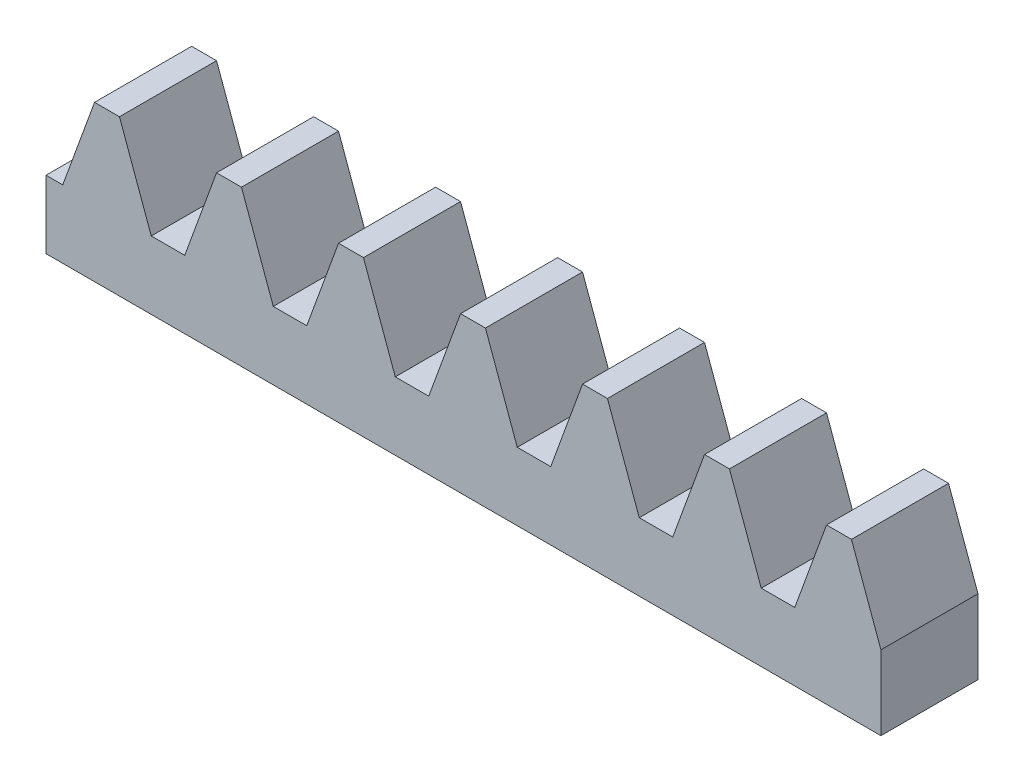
ISO-10303-21;
HEADER;
FILE_DESCRIPTION(('STEP AP214'),'2;1');
FILE_NAME('part.step','',(''),(''),'','','');
FILE_SCHEMA(('AUTOMOTIVE_DESIGN { 1 0 10303 214 1 1 1 1 }'));
ENDSEC;
DATA;
#1=APPLICATION_CONTEXT('core data for automotive mechanical design processes');
#2=APPLICATION_PROTOCOL_DEFINITION('international standard','automotive_design',2000,#1);
#3=PRODUCT_CONTEXT('',#1,'mechanical');
#4=PRODUCT('Part','Part','',(#3));
#5=PRODUCT_RELATED_PRODUCT_CATEGORY('part','',(#4));
#6=PRODUCT_DEFINITION_FORMATION('','',#4);
#7=PRODUCT_DEFINITION_CONTEXT('part definition',#1,'design');
#8=PRODUCT_DEFINITION('design','',#6,#7);
#9=PRODUCT_DEFINITION_SHAPE('','',#8);
#10=(LENGTH_UNIT() NAMED_UNIT(*) SI_UNIT(.MILLI.,.METRE.));
#11=(NAMED_UNIT(*) PLANE_ANGLE_UNIT() SI_UNIT($,.RADIAN.));
#12=(NAMED_UNIT(*) SI_UNIT($,.STERADIAN.) SOLID_ANGLE_UNIT());
#13=UNCERTAINTY_MEASURE_WITH_UNIT(LENGTH_MEASURE(1.E-05),#10,'distance_accuracy_value','');
#14=(GEOMETRIC_REPRESENTATION_CONTEXT(3) GLOBAL_UNCERTAINTY_ASSIGNED_CONTEXT((#13)) GLOBAL_UNIT_ASSIGNED_CONTEXT((#10,
#11,#12)) REPRESENTATION_CONTEXT('',''));
#15=CARTESIAN_POINT('',(0.,0.,0.));
#16=DIRECTION('',(0.,0.,1.));
#17=DIRECTION('',(1.,0.,0.));
#18=AXIS2_PLACEMENT_3D('',#15,#16,#17);
#19=CARTESIAN_POINT('',(0.,8.,-5.));
#20=DIRECTION('',(0.,1.,0.));
#21=DIRECTION('',(0.,0.,1.));
#22=AXIS2_PLACEMENT_3D('',#19,#20,#21);
#23=PLANE('',#22);
#24=DIRECTION('',(0.,0.,1.));
#25=VECTOR('',#24,1.);
#26=CARTESIAN_POINT('',(35.1993750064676,8.,-5.));
#27=LINE('',#26,#25);
#28=CARTESIAN_POINT('',(35.1993750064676,8.,-5.));
#29=VERTEX_POINT('',#28);
#30=CARTESIAN_POINT('',(35.1993750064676,8.,0.));
#31=VERTEX_POINT('',#30);
#32=EDGE_CURVE('E297',#29,#31,#27,.T.);
#33=ORIENTED_EDGE('',*,*,#32,.F.);
#34=DIRECTION('',(-1.,0.,0.));
#35=VECTOR('',#34,1.);
#36=CARTESIAN_POINT('',(0.,8.,-5.));
#37=LINE('',#36,#35);
#38=CARTESIAN_POINT('',(33.9156632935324,8.,-5.));
#39=VERTEX_POINT('',#38);
#40=EDGE_CURVE('E367',#29,#39,#37,.T.);
#41=ORIENTED_EDGE('',*,*,#40,.T.);
#42=DIRECTION('',(0.,0.,-1.));
#43=VECTOR('',#42,1.);
#44=CARTESIAN_POINT('',(33.9156632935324,8.,-5.));
#45=LINE('',#44,#43);
#46=CARTESIAN_POINT('',(33.9156632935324,8.,0.));
#47=VERTEX_POINT('',#46);
#48=EDGE_CURVE('E300',#47,#39,#45,.T.);
#49=ORIENTED_EDGE('',*,*,#48,.F.);
#50=DIRECTION('',(-1.,0.,0.));
#51=VECTOR('',#50,1.);
#52=CARTESIAN_POINT('',(0.,8.,0.));
#53=LINE('',#52,#51);
#54=EDGE_CURVE('E262',#31,#47,#53,.T.);
#55=ORIENTED_EDGE('',*,*,#54,.F.);
#56=EDGE_LOOP('',(#33,#41,#49,#55));
#57=FACE_BOUND('',#56,.T.);
#58=ADVANCED_FACE('F32',(#57),#23,.T.);
#59=DIRECTION('',(0.,0.,1.));
#60=VECTOR('',#59,1.);
#61=CARTESIAN_POINT('',(28.9161897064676,8.,-5.));
#62=LINE('',#61,#60);
#63=CARTESIAN_POINT('',(28.9161897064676,8.,-5.));
#64=VERTEX_POINT('',#63);
#65=CARTESIAN_POINT('',(28.9161897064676,8.,0.));
#66=VERTEX_POINT('',#65);
#67=EDGE_CURVE('E422',#64,#66,#62,.T.);
#68=ORIENTED_EDGE('',*,*,#67,.F.);
#69=CARTESIAN_POINT('',(27.6324779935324,8.,-5.));
#70=VERTEX_POINT('',#69);
#71=EDGE_CURVE('E564',#64,#70,#37,.T.);
#72=ORIENTED_EDGE('',*,*,#71,.T.);
#73=DIRECTION('',(0.,0.,-1.));
#74=VECTOR('',#73,1.);
#75=CARTESIAN_POINT('',(27.6324779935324,8.,-5.));
#76=LINE('',#75,#74);
#77=CARTESIAN_POINT('',(27.6324779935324,8.,0.));
#78=VERTEX_POINT('',#77);
#79=EDGE_CURVE('E441',#78,#70,#76,.T.);
#80=ORIENTED_EDGE('',*,*,#79,.F.);
#81=EDGE_CURVE('E301',#66,#78,#53,.T.);
#82=ORIENTED_EDGE('',*,*,#81,.F.);
#83=EDGE_LOOP('',(#68,#72,#80,#82));
#84=FACE_BOUND('',#83,.T.);
#85=ADVANCED_FACE('F527',(#84),#23,.T.);
#86=DIRECTION('',(0.,0.,1.));
#87=VECTOR('',#86,1.);
#88=CARTESIAN_POINT('',(22.6330044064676,8.,-5.));
#89=LINE('',#88,#87);
#90=CARTESIAN_POINT('',(22.6330044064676,8.,-5.));
#91=VERTEX_POINT('',#90);
#92=CARTESIAN_POINT('',(22.6330044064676,8.,0.));
#93=VERTEX_POINT('',#92);
#94=EDGE_CURVE('E445',#91,#93,#89,.T.);
#95=ORIENTED_EDGE('',*,*,#94,.F.);
#96=CARTESIAN_POINT('',(21.3492926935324,8.,-5.));
#97=VERTEX_POINT('',#96);
#98=EDGE_CURVE('E563',#91,#97,#37,.T.);
#99=ORIENTED_EDGE('',*,*,#98,.T.);
#100=DIRECTION('',(0.,0.,-1.));
#101=VECTOR('',#100,1.);
#102=CARTESIAN_POINT('',(21.3492926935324,8.,-5.));
#103=LINE('',#102,#101);
#104=CARTESIAN_POINT('',(21.3492926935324,8.,0.));
#105=VERTEX_POINT('',#104);
#106=EDGE_CURVE('E464',#105,#97,#103,.T.);
#107=ORIENTED_EDGE('',*,*,#106,.F.);
#108=EDGE_CURVE('E302',#93,#105,#53,.T.);
#109=ORIENTED_EDGE('',*,*,#108,.F.);
#110=EDGE_LOOP('',(#95,#99,#107,#109));
#111=FACE_BOUND('',#110,.T.);
#112=ADVANCED_FACE('F533',(#111),#23,.T.);
#113=DIRECTION('',(0.,0.,1.));
#114=VECTOR('',#113,1.);
#115=CARTESIAN_POINT('',(16.3498191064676,8.,-5.));
#116=LINE('',#115,#114);
#117=CARTESIAN_POINT('',(16.3498191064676,8.,-5.));
#118=VERTEX_POINT('',#117);
#119=CARTESIAN_POINT('',(16.3498191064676,8.,0.));
#120=VERTEX_POINT('',#119);
#121=EDGE_CURVE('E468',#118,#120,#116,.T.);
#122=ORIENTED_EDGE('',*,*,#121,.F.);
#123=CARTESIAN_POINT('',(15.0661073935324,8.,-5.));
#124=VERTEX_POINT('',#123);
#125=EDGE_CURVE('E559',#118,#124,#37,.T.);
#126=ORIENTED_EDGE('',*,*,#125,.T.);
#127=DIRECTION('',(0.,0.,-1.));
#128=VECTOR('',#127,1.);
#129=CARTESIAN_POINT('',(15.0661073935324,8.,-5.));
#130=LINE('',#129,#128);
#131=CARTESIAN_POINT('',(15.0661073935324,8.,0.));
#132=VERTEX_POINT('',#131);
#133=EDGE_CURVE('E487',#132,#124,#130,.T.);
#134=ORIENTED_EDGE('',*,*,#133,.F.);
#135=EDGE_CURVE('E306',#120,#132,#53,.T.);
#136=ORIENTED_EDGE('',*,*,#135,.F.);
#137=EDGE_LOOP('',(#122,#126,#134,#136));
#138=FACE_BOUND('',#137,.T.);
#139=ADVANCED_FACE('F547',(#138),#23,.T.);
#140=DIRECTION('',(0.,0.,1.));
#141=VECTOR('',#140,1.);
#142=CARTESIAN_POINT('',(10.0666338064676,8.,-5.));
#143=LINE('',#142,#141);
#144=CARTESIAN_POINT('',(10.0666338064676,8.,-5.));
#145=VERTEX_POINT('',#144);
#146=CARTESIAN_POINT('',(10.0666338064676,8.,0.));
#147=VERTEX_POINT('',#146);
#148=EDGE_CURVE('E491',#145,#147,#143,.T.);
#149=ORIENTED_EDGE('',*,*,#148,.F.);
#150=CARTESIAN_POINT('',(8.78292209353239,8.,-5.));
#151=VERTEX_POINT('',#150);
#152=EDGE_CURVE('E336',#145,#151,#37,.T.);
#153=ORIENTED_EDGE('',*,*,#152,.T.);
#154=DIRECTION('',(0.,0.,-1.));
#155=VECTOR('',#154,1.);
#156=CARTESIAN_POINT('',(8.78292209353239,8.,-5.));
#157=LINE('',#156,#155);
#158=CARTESIAN_POINT('',(8.78292209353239,8.,0.));
#159=VERTEX_POINT('',#158);
#160=EDGE_CURVE('E327',#159,#151,#157,.T.);
#161=ORIENTED_EDGE('',*,*,#160,.F.);
#162=EDGE_CURVE('E254',#147,#159,#53,.T.);
#163=ORIENTED_EDGE('',*,*,#162,.F.);
#164=EDGE_LOOP('',(#149,#153,#161,#163));
#165=FACE_BOUND('',#164,.T.);
#166=ADVANCED_FACE('F334',(#165),#23,.T.);
#167=DIRECTION('',(0.,0.,1.));
#168=VECTOR('',#167,1.);
#169=CARTESIAN_POINT('',(3.78344850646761,8.,-5.));
#170=LINE('',#169,#168);
#171=CARTESIAN_POINT('',(3.78344850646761,8.,-5.));
#172=VERTEX_POINT('',#171);
#173=CARTESIAN_POINT('',(3.78344850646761,8.,0.));
#174=VERTEX_POINT('',#173);
#175=EDGE_CURVE('E337',#172,#174,#170,.T.);
#176=ORIENTED_EDGE('',*,*,#175,.F.);
#177=CARTESIAN_POINT('',(2.49973679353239,8.,-5.));
#178=VERTEX_POINT('',#177);
#179=EDGE_CURVE('E366',#172,#178,#37,.T.);
#180=ORIENTED_EDGE('',*,*,#179,.T.);
#181=DIRECTION('',(0.,0.,-1.));
#182=VECTOR('',#181,1.);
#183=CARTESIAN_POINT('',(2.49973679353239,8.,-5.));
#184=LINE('',#183,#182);
#185=CARTESIAN_POINT('',(2.49973679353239,8.,0.));
#186=VERTEX_POINT('',#185);
#187=EDGE_CURVE('E358',#186,#178,#184,.T.);
#188=ORIENTED_EDGE('',*,*,#187,.F.);
#189=EDGE_CURVE('E252',#174,#186,#53,.T.);
#190=ORIENTED_EDGE('',*,*,#189,.F.);
#191=EDGE_LOOP('',(#176,#180,#188,#190));
#192=FACE_BOUND('',#191,.T.);
#193=ADVANCED_FACE('F509',(#192),#23,.T.);
#194=CARTESIAN_POINT('',(0.,0.,-5.));
#195=DIRECTION('',(-1.,0.,0.));
#196=DIRECTION('',(0.,0.,1.));
#197=AXIS2_PLACEMENT_3D('',#194,#195,#196);
#198=PLANE('',#197);
#199=DIRECTION('',(0.,0.,1.));
#200=VECTOR('',#199,1.);
#201=CARTESIAN_POINT('',(0.,3.5,-5.));
#202=LINE('',#201,#200);
#203=CARTESIAN_POINT('',(0.,3.5,-5.));
#204=VERTEX_POINT('',#203);
#205=CARTESIAN_POINT('',(0.,3.5,0.));
#206=VERTEX_POINT('',#205);
#207=EDGE_CURVE('E356',#204,#206,#202,.T.);
#208=ORIENTED_EDGE('',*,*,#207,.F.);
#209=DIRECTION('',(0.,-1.,0.));
#210=VECTOR('',#209,1.);
#211=CARTESIAN_POINT('',(0.,0.,-5.));
#212=LINE('',#211,#210);
#213=CARTESIAN_POINT('',(0.,0.,-5.));
#214=VERTEX_POINT('',#213);
#215=EDGE_CURVE('E261',#204,#214,#212,.T.);
#216=ORIENTED_EDGE('',*,*,#215,.T.);
#217=DIRECTION('',(0.,0.,1.));
#218=VECTOR('',#217,1.);
#219=CARTESIAN_POINT('',(0.,0.,-5.));
#220=LINE('',#219,#218);
#221=CARTESIAN_POINT('',(0.,0.,0.));
#222=VERTEX_POINT('',#221);
#223=EDGE_CURVE('E266',#214,#222,#220,.T.);
#224=ORIENTED_EDGE('',*,*,#223,.T.);
#225=DIRECTION('',(0.,-1.,0.));
#226=VECTOR('',#225,1.);
#227=CARTESIAN_POINT('',(0.,0.,0.));
#228=LINE('',#227,#226);
#229=EDGE_CURVE('E257',#206,#222,#228,.T.);
#230=ORIENTED_EDGE('',*,*,#229,.F.);
#231=EDGE_LOOP('',(#208,#216,#224,#230));
#232=FACE_BOUND('',#231,.T.);
#233=ADVANCED_FACE('F34',(#232),#198,.T.);
#234=DIRECTION('',(0.,0.,1.));
#235=VECTOR('',#234,1.);
#236=CARTESIAN_POINT('',(41.4825603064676,8.,-5.));
#237=LINE('',#236,#235);
#238=CARTESIAN_POINT('',(41.4825603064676,8.,-5.));
#239=VERTEX_POINT('',#238);
#240=CARTESIAN_POINT('',(41.4825603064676,8.,0.));
#241=VERTEX_POINT('',#240);
#242=EDGE_CURVE('E47',#239,#241,#237,.T.);
#243=ORIENTED_EDGE('',*,*,#242,.F.);
#244=CARTESIAN_POINT('',(40.1988485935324,8.,-5.));
#245=VERTEX_POINT('',#244);
#246=EDGE_CURVE('E269',#239,#245,#37,.T.);
#247=ORIENTED_EDGE('',*,*,#246,.T.);
#248=DIRECTION('',(0.,0.,-1.));
#249=VECTOR('',#248,1.);
#250=CARTESIAN_POINT('',(40.1988485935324,8.,-5.));
#251=LINE('',#250,#249);
#252=CARTESIAN_POINT('',(40.1988485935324,8.,0.));
#253=VERTEX_POINT('',#252);
#254=EDGE_CURVE('E398',#253,#245,#251,.T.);
#255=ORIENTED_EDGE('',*,*,#254,.F.);
#256=EDGE_CURVE('E256',#241,#253,#53,.T.);
#257=ORIENTED_EDGE('',*,*,#256,.F.);
#258=EDGE_LOOP('',(#243,#247,#255,#257));
#259=FACE_BOUND('',#258,.T.);
#260=ADVANCED_FACE('F529',(#259),#23,.T.);
#261=CARTESIAN_POINT('',(43.,0.,-5.));
#262=DIRECTION('',(1.,0.,0.));
#263=DIRECTION('',(0.,0.,-1.));
#264=AXIS2_PLACEMENT_3D('',#261,#262,#263);
#265=PLANE('',#264);
#266=DIRECTION('',(0.,0.,-1.));
#267=VECTOR('',#266,1.);
#268=CARTESIAN_POINT('',(43.,3.83086870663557,-5.));
#269=LINE('',#268,#267);
#270=CARTESIAN_POINT('',(43.,3.83086870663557,0.));
#271=VERTEX_POINT('',#270);
#272=CARTESIAN_POINT('',(43.,3.83086870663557,-5.));
#273=VERTEX_POINT('',#272);
#274=EDGE_CURVE('E234',#271,#273,#269,.T.);
#275=ORIENTED_EDGE('',*,*,#274,.F.);
#276=DIRECTION('',(0.,1.,0.));
#277=VECTOR('',#276,1.);
#278=CARTESIAN_POINT('',(43.,0.,0.));
#279=LINE('',#278,#277);
#280=CARTESIAN_POINT('',(43.,0.,0.));
#281=VERTEX_POINT('',#280);
#282=EDGE_CURVE('E243',#281,#271,#279,.T.);
#283=ORIENTED_EDGE('',*,*,#282,.F.);
#284=DIRECTION('',(0.,0.,1.));
#285=VECTOR('',#284,1.);
#286=CARTESIAN_POINT('',(43.,0.,-5.));
#287=LINE('',#286,#285);
#288=CARTESIAN_POINT('',(43.,0.,-5.));
#289=VERTEX_POINT('',#288);
#290=EDGE_CURVE('E263',#289,#281,#287,.T.);
#291=ORIENTED_EDGE('',*,*,#290,.F.);
#292=DIRECTION('',(0.,1.,0.));
#293=VECTOR('',#292,1.);
#294=CARTESIAN_POINT('',(43.,0.,-5.));
#295=LINE('',#294,#293);
#296=EDGE_CURVE('E246',#289,#273,#295,.T.);
#297=ORIENTED_EDGE('',*,*,#296,.T.);
#298=EDGE_LOOP('',(#275,#283,#291,#297));
#299=FACE_BOUND('',#298,.T.);
#300=ADVANCED_FACE('F242',(#299),#265,.T.);
#301=CARTESIAN_POINT('',(0.,0.,-5.));
#302=DIRECTION('',(0.,-1.,0.));
#303=DIRECTION('',(0.,0.,-1.));
#304=AXIS2_PLACEMENT_3D('',#301,#302,#303);
#305=PLANE('',#304);
#306=DIRECTION('',(1.,0.,0.));
#307=VECTOR('',#306,1.);
#308=CARTESIAN_POINT('',(0.,0.,0.));
#309=LINE('',#308,#307);
#310=EDGE_CURVE('E251',#222,#281,#309,.T.);
#311=ORIENTED_EDGE('',*,*,#310,.F.);
#312=ORIENTED_EDGE('',*,*,#223,.F.);
#313=DIRECTION('',(1.,0.,0.));
#314=VECTOR('',#313,1.);
#315=CARTESIAN_POINT('',(0.,0.,-5.));
#316=LINE('',#315,#314);
#317=EDGE_CURVE('E362',#214,#289,#316,.T.);
#318=ORIENTED_EDGE('',*,*,#317,.T.);
#319=ORIENTED_EDGE('',*,*,#290,.T.);
#320=EDGE_LOOP('',(#311,#312,#318,#319));
#321=FACE_BOUND('',#320,.T.);
#322=ADVANCED_FACE('F376',(#321),#305,.T.);
#323=CARTESIAN_POINT('',(0.,8.,-5.));
#324=DIRECTION('',(0.,0.,-1.));
#325=DIRECTION('',(-1.,0.,0.));
#326=AXIS2_PLACEMENT_3D('',#323,#324,#325);
#327=PLANE('',#326);
#328=DIRECTION('',(0.342020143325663,-0.939692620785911,0.));
#329=VECTOR('',#328,1.);
#330=CARTESIAN_POINT('',(41.4733154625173,8.0254,-5.));
#331=LINE('',#330,#329);
#332=EDGE_CURVE('E247',#239,#273,#331,.T.);
#333=ORIENTED_EDGE('',*,*,#332,.T.);
#334=ORIENTED_EDGE('',*,*,#296,.F.);
#335=ORIENTED_EDGE('',*,*,#317,.F.);
#336=ORIENTED_EDGE('',*,*,#215,.F.);
#337=DIRECTION('',(1.,0.,0.));
#338=VECTOR('',#337,1.);
#339=CARTESIAN_POINT('',(0.861870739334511,3.5,-5.));
#340=LINE('',#339,#338);
#341=CARTESIAN_POINT('',(0.861870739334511,3.5,-5.));
#342=VERTEX_POINT('',#341);
#343=EDGE_CURVE('E345',#204,#342,#340,.T.);
#344=ORIENTED_EDGE('',*,*,#343,.T.);
#345=DIRECTION('',(0.342020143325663,0.939692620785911,0.));
#346=VECTOR('',#345,1.);
#347=CARTESIAN_POINT('',(2.50898163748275,8.0254,-5.));
#348=LINE('',#347,#346);
#349=EDGE_CURVE('E348',#342,#178,#348,.T.);
#350=ORIENTED_EDGE('',*,*,#349,.T.);
#351=ORIENTED_EDGE('',*,*,#179,.F.);
#352=DIRECTION('',(0.342020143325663,-0.939692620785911,0.));
#353=VECTOR('',#352,1.);
#354=CARTESIAN_POINT('',(3.77420366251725,8.0254,-5.));
#355=LINE('',#354,#353);
#356=CARTESIAN_POINT('',(5.42131456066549,3.5,-5.));
#357=VERTEX_POINT('',#356);
#358=EDGE_CURVE('E331',#172,#357,#355,.T.);
#359=ORIENTED_EDGE('',*,*,#358,.T.);
#360=DIRECTION('',(1.,0.,0.));
#361=VECTOR('',#360,1.);
#362=CARTESIAN_POINT('',(7.14505603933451,3.5,-5.));
#363=LINE('',#362,#361);
#364=CARTESIAN_POINT('',(7.14505603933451,3.5,-5.));
#365=VERTEX_POINT('',#364);
#366=EDGE_CURVE('E495',#357,#365,#363,.T.);
#367=ORIENTED_EDGE('',*,*,#366,.T.);
#368=DIRECTION('',(0.342020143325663,0.939692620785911,0.));
#369=VECTOR('',#368,1.);
#370=CARTESIAN_POINT('',(8.79216693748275,8.0254,-5.));
#371=LINE('',#370,#369);
#372=EDGE_CURVE('E498',#365,#151,#371,.T.);
#373=ORIENTED_EDGE('',*,*,#372,.T.);
#374=ORIENTED_EDGE('',*,*,#152,.F.);
#375=DIRECTION('',(0.342020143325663,-0.939692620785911,0.));
#376=VECTOR('',#375,1.);
#377=CARTESIAN_POINT('',(10.0573889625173,8.0254,-5.));
#378=LINE('',#377,#376);
#379=CARTESIAN_POINT('',(11.7044998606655,3.5,-5.));
#380=VERTEX_POINT('',#379);
#381=EDGE_CURVE('E471',#145,#380,#378,.T.);
#382=ORIENTED_EDGE('',*,*,#381,.T.);
#383=DIRECTION('',(1.,0.,0.));
#384=VECTOR('',#383,1.);
#385=CARTESIAN_POINT('',(13.4282413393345,3.5,-5.));
#386=LINE('',#385,#384);
#387=CARTESIAN_POINT('',(13.4282413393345,3.5,-5.));
#388=VERTEX_POINT('',#387);
#389=EDGE_CURVE('E474',#380,#388,#386,.T.);
#390=ORIENTED_EDGE('',*,*,#389,.T.);
#391=DIRECTION('',(0.342020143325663,0.939692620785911,0.));
#392=VECTOR('',#391,1.);
#393=CARTESIAN_POINT('',(15.0753522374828,8.0254,-5.));
#394=LINE('',#393,#392);
#395=EDGE_CURVE('E478',#388,#124,#394,.T.);
#396=ORIENTED_EDGE('',*,*,#395,.T.);
#397=ORIENTED_EDGE('',*,*,#125,.F.);
#398=DIRECTION('',(0.342020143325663,-0.939692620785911,0.));
#399=VECTOR('',#398,1.);
#400=CARTESIAN_POINT('',(16.3405742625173,8.0254,-5.));
#401=LINE('',#400,#399);
#402=CARTESIAN_POINT('',(17.9876851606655,3.5,-5.));
#403=VERTEX_POINT('',#402);
#404=EDGE_CURVE('E448',#118,#403,#401,.T.);
#405=ORIENTED_EDGE('',*,*,#404,.T.);
#406=DIRECTION('',(1.,0.,0.));
#407=VECTOR('',#406,1.);
#408=CARTESIAN_POINT('',(19.7114266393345,3.5,-5.));
#409=LINE('',#408,#407);
#410=CARTESIAN_POINT('',(19.7114266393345,3.5,-5.));
#411=VERTEX_POINT('',#410);
#412=EDGE_CURVE('E451',#403,#411,#409,.T.);
#413=ORIENTED_EDGE('',*,*,#412,.T.);
#414=DIRECTION('',(0.342020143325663,0.939692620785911,0.));
#415=VECTOR('',#414,1.);
#416=CARTESIAN_POINT('',(21.3585375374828,8.0254,-5.));
#417=LINE('',#416,#415);
#418=EDGE_CURVE('E455',#411,#97,#417,.T.);
#419=ORIENTED_EDGE('',*,*,#418,.T.);
#420=ORIENTED_EDGE('',*,*,#98,.F.);
#421=DIRECTION('',(0.342020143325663,-0.939692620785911,0.));
#422=VECTOR('',#421,1.);
#423=CARTESIAN_POINT('',(22.6237595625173,8.0254,-5.));
#424=LINE('',#423,#422);
#425=CARTESIAN_POINT('',(24.2708704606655,3.5,-5.));
#426=VERTEX_POINT('',#425);
#427=EDGE_CURVE('E425',#91,#426,#424,.T.);
#428=ORIENTED_EDGE('',*,*,#427,.T.);
#429=DIRECTION('',(1.,0.,0.));
#430=VECTOR('',#429,1.);
#431=CARTESIAN_POINT('',(25.9946119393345,3.5,-5.));
#432=LINE('',#431,#430);
#433=CARTESIAN_POINT('',(25.9946119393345,3.5,-5.));
#434=VERTEX_POINT('',#433);
#435=EDGE_CURVE('E428',#426,#434,#432,.T.);
#436=ORIENTED_EDGE('',*,*,#435,.T.);
#437=DIRECTION('',(0.342020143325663,0.939692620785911,0.));
#438=VECTOR('',#437,1.);
#439=CARTESIAN_POINT('',(27.6417228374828,8.0254,-5.));
#440=LINE('',#439,#438);
#441=EDGE_CURVE('E432',#434,#70,#440,.T.);
#442=ORIENTED_EDGE('',*,*,#441,.T.);
#443=ORIENTED_EDGE('',*,*,#71,.F.);
#444=DIRECTION('',(0.342020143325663,-0.939692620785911,0.));
#445=VECTOR('',#444,1.);
#446=CARTESIAN_POINT('',(28.9069448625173,8.0254,-5.));
#447=LINE('',#446,#445);
#448=CARTESIAN_POINT('',(30.5540557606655,3.5,-5.));
#449=VERTEX_POINT('',#448);
#450=EDGE_CURVE('E404',#64,#449,#447,.T.);
#451=ORIENTED_EDGE('',*,*,#450,.T.);
#452=DIRECTION('',(1.,0.,0.));
#453=VECTOR('',#452,1.);
#454=CARTESIAN_POINT('',(32.2777972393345,3.5,-5.));
#455=LINE('',#454,#453);
#456=CARTESIAN_POINT('',(32.2777972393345,3.5,-5.));
#457=VERTEX_POINT('',#456);
#458=EDGE_CURVE('E407',#449,#457,#455,.T.);
#459=ORIENTED_EDGE('',*,*,#458,.T.);
#460=DIRECTION('',(0.342020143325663,0.939692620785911,0.));
#461=VECTOR('',#460,1.);
#462=CARTESIAN_POINT('',(33.9249081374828,8.0254,-5.));
#463=LINE('',#462,#461);
#464=EDGE_CURVE('E411',#457,#39,#463,.T.);
#465=ORIENTED_EDGE('',*,*,#464,.T.);
#466=ORIENTED_EDGE('',*,*,#40,.F.);
#467=DIRECTION('',(0.342020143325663,-0.939692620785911,0.));
#468=VECTOR('',#467,1.);
#469=CARTESIAN_POINT('',(35.1901301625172,8.0254,-5.));
#470=LINE('',#469,#468);
#471=CARTESIAN_POINT('',(36.8372410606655,3.5,-5.));
#472=VERTEX_POINT('',#471);
#473=EDGE_CURVE('E384',#29,#472,#470,.T.);
#474=ORIENTED_EDGE('',*,*,#473,.T.);
#475=DIRECTION('',(1.,0.,0.));
#476=VECTOR('',#475,1.);
#477=CARTESIAN_POINT('',(38.5609825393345,3.5,-5.));
#478=LINE('',#477,#476);
#479=CARTESIAN_POINT('',(38.5609825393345,3.5,-5.));
#480=VERTEX_POINT('',#479);
#481=EDGE_CURVE('E387',#472,#480,#478,.T.);
#482=ORIENTED_EDGE('',*,*,#481,.T.);
#483=DIRECTION('',(0.342020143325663,0.939692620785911,0.));
#484=VECTOR('',#483,1.);
#485=CARTESIAN_POINT('',(40.2080934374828,8.0254,-5.));
#486=LINE('',#485,#484);
#487=EDGE_CURVE('E391',#480,#245,#486,.T.);
#488=ORIENTED_EDGE('',*,*,#487,.T.);
#489=ORIENTED_EDGE('',*,*,#246,.F.);
#490=EDGE_LOOP('',(#333,#334,#335,#336,#344,#350,#351,#359,#367,#373,#374,#382,#390,#396,#397,
#405,#413,#419,#420,#428,#436,#442,#443,#451,#459,#465,#466,#474,#482,#488,#489));
#491=FACE_BOUND('',#490,.T.);
#492=ADVANCED_FACE('F378',(#491),#327,.T.);
#493=CARTESIAN_POINT('',(0.,8.,0.));
#494=DIRECTION('',(0.,0.,-1.));
#495=DIRECTION('',(-1.,0.,0.));
#496=AXIS2_PLACEMENT_3D('',#493,#494,#495);
#497=PLANE('',#496);
#498=ORIENTED_EDGE('',*,*,#282,.T.);
#499=DIRECTION('',(-0.342020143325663,0.939692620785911,0.));
#500=VECTOR('',#499,1.);
#501=CARTESIAN_POINT('',(36.6300225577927,21.3322378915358,0.));
#502=LINE('',#501,#500);
#503=EDGE_CURVE('E11',#271,#241,#502,.T.);
#504=ORIENTED_EDGE('',*,*,#503,.T.);
#505=ORIENTED_EDGE('',*,*,#256,.T.);
#506=DIRECTION('',(0.342020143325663,0.939692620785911,0.));
#507=VECTOR('',#506,1.);
#508=CARTESIAN_POINT('',(40.2080934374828,8.0254,0.));
#509=LINE('',#508,#507);
#510=CARTESIAN_POINT('',(38.5609825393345,3.5,0.));
#511=VERTEX_POINT('',#510);
#512=EDGE_CURVE('E388',#511,#253,#509,.T.);
#513=ORIENTED_EDGE('',*,*,#512,.F.);
#514=DIRECTION('',(1.,0.,0.));
#515=VECTOR('',#514,1.);
#516=CARTESIAN_POINT('',(38.5609825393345,3.5,0.));
#517=LINE('',#516,#515);
#518=CARTESIAN_POINT('',(36.8372410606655,3.5,0.));
#519=VERTEX_POINT('',#518);
#520=EDGE_CURVE('E292',#519,#511,#517,.T.);
#521=ORIENTED_EDGE('',*,*,#520,.F.);
#522=DIRECTION('',(-0.342020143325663,0.939692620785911,0.));
#523=VECTOR('',#522,1.);
#524=CARTESIAN_POINT('',(31.0818303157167,19.3128610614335,0.));
#525=LINE('',#524,#523);
#526=EDGE_CURVE('E40',#519,#31,#525,.T.);
#527=ORIENTED_EDGE('',*,*,#526,.T.);
#528=ORIENTED_EDGE('',*,*,#54,.T.);
#529=DIRECTION('',(0.342020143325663,0.939692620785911,0.));
#530=VECTOR('',#529,1.);
#531=CARTESIAN_POINT('',(33.9249081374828,8.0254,0.));
#532=LINE('',#531,#530);
#533=CARTESIAN_POINT('',(32.2777972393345,3.5,0.));
#534=VERTEX_POINT('',#533);
#535=EDGE_CURVE('E408',#534,#47,#532,.T.);
#536=ORIENTED_EDGE('',*,*,#535,.F.);
#537=DIRECTION('',(1.,0.,0.));
#538=VECTOR('',#537,1.);
#539=CARTESIAN_POINT('',(32.2777972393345,3.5,0.));
#540=LINE('',#539,#538);
#541=CARTESIAN_POINT('',(30.5540557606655,3.5,0.));
#542=VERTEX_POINT('',#541);
#543=EDGE_CURVE('E403',#542,#534,#540,.T.);
#544=ORIENTED_EDGE('',*,*,#543,.F.);
#545=DIRECTION('',(-0.342020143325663,0.939692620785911,0.));
#546=VECTOR('',#545,1.);
#547=CARTESIAN_POINT('',(25.5336380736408,17.2934842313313,0.));
#548=LINE('',#547,#546);
#549=EDGE_CURVE('E284',#542,#66,#548,.T.);
#550=ORIENTED_EDGE('',*,*,#549,.T.);
#551=ORIENTED_EDGE('',*,*,#81,.T.);
#552=DIRECTION('',(0.342020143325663,0.939692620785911,0.));
#553=VECTOR('',#552,1.);
#554=CARTESIAN_POINT('',(27.6417228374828,8.0254,0.));
#555=LINE('',#554,#553);
#556=CARTESIAN_POINT('',(25.9946119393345,3.5,0.));
#557=VERTEX_POINT('',#556);
#558=EDGE_CURVE('E429',#557,#78,#555,.T.);
#559=ORIENTED_EDGE('',*,*,#558,.F.);
#560=DIRECTION('',(1.,0.,0.));
#561=VECTOR('',#560,1.);
#562=CARTESIAN_POINT('',(25.9946119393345,3.5,0.));
#563=LINE('',#562,#561);
#564=CARTESIAN_POINT('',(24.2708704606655,3.5,0.));
#565=VERTEX_POINT('',#564);
#566=EDGE_CURVE('E424',#565,#557,#563,.T.);
#567=ORIENTED_EDGE('',*,*,#566,.F.);
#568=DIRECTION('',(-0.342020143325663,0.939692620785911,0.));
#569=VECTOR('',#568,1.);
#570=CARTESIAN_POINT('',(19.9854458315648,15.274107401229,0.));
#571=LINE('',#570,#569);
#572=EDGE_CURVE('E281',#565,#93,#571,.T.);
#573=ORIENTED_EDGE('',*,*,#572,.T.);
#574=ORIENTED_EDGE('',*,*,#108,.T.);
#575=DIRECTION('',(0.342020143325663,0.939692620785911,0.));
#576=VECTOR('',#575,1.);
#577=CARTESIAN_POINT('',(21.3585375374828,8.0254,0.));
#578=LINE('',#577,#576);
#579=CARTESIAN_POINT('',(19.7114266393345,3.5,0.));
#580=VERTEX_POINT('',#579);
#581=EDGE_CURVE('E452',#580,#105,#578,.T.);
#582=ORIENTED_EDGE('',*,*,#581,.F.);
#583=DIRECTION('',(1.,0.,0.));
#584=VECTOR('',#583,1.);
#585=CARTESIAN_POINT('',(19.7114266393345,3.5,0.));
#586=LINE('',#585,#584);
#587=CARTESIAN_POINT('',(17.9876851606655,3.5,0.));
#588=VERTEX_POINT('',#587);
#589=EDGE_CURVE('E447',#588,#580,#586,.T.);
#590=ORIENTED_EDGE('',*,*,#589,.F.);
#591=DIRECTION('',(-0.342020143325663,0.939692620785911,0.));
#592=VECTOR('',#591,1.);
#593=CARTESIAN_POINT('',(14.4372535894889,13.2547305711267,0.));
#594=LINE('',#593,#592);
#595=EDGE_CURVE('E278',#588,#120,#594,.T.);
#596=ORIENTED_EDGE('',*,*,#595,.T.);
#597=ORIENTED_EDGE('',*,*,#135,.T.);
#598=DIRECTION('',(0.342020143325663,0.939692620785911,0.));
#599=VECTOR('',#598,1.);
#600=CARTESIAN_POINT('',(15.0753522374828,8.0254,0.));
#601=LINE('',#600,#599);
#602=CARTESIAN_POINT('',(13.4282413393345,3.5,0.));
#603=VERTEX_POINT('',#602);
#604=EDGE_CURVE('E475',#603,#132,#601,.T.);
#605=ORIENTED_EDGE('',*,*,#604,.F.);
#606=DIRECTION('',(1.,0.,0.));
#607=VECTOR('',#606,1.);
#608=CARTESIAN_POINT('',(13.4282413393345,3.5,0.));
#609=LINE('',#608,#607);
#610=CARTESIAN_POINT('',(11.7044998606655,3.5,0.));
#611=VERTEX_POINT('',#610);
#612=EDGE_CURVE('E470',#611,#603,#609,.T.);
#613=ORIENTED_EDGE('',*,*,#612,.F.);
#614=DIRECTION('',(-0.342020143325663,0.939692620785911,0.));
#615=VECTOR('',#614,1.);
#616=CARTESIAN_POINT('',(8.88906134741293,11.2353537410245,0.));
#617=LINE('',#616,#615);
#618=EDGE_CURVE('E275',#611,#147,#617,.T.);
#619=ORIENTED_EDGE('',*,*,#618,.T.);
#620=ORIENTED_EDGE('',*,*,#162,.T.);
#621=DIRECTION('',(0.342020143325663,0.939692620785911,0.));
#622=VECTOR('',#621,1.);
#623=CARTESIAN_POINT('',(8.79216693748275,8.0254,0.));
#624=LINE('',#623,#622);
#625=CARTESIAN_POINT('',(7.14505603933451,3.5,0.));
#626=VERTEX_POINT('',#625);
#627=EDGE_CURVE('E317',#626,#159,#624,.T.);
#628=ORIENTED_EDGE('',*,*,#627,.F.);
#629=DIRECTION('',(1.,0.,0.));
#630=VECTOR('',#629,1.);
#631=CARTESIAN_POINT('',(7.14505603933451,3.5,0.));
#632=LINE('',#631,#630);
#633=CARTESIAN_POINT('',(5.42131456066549,3.5,0.));
#634=VERTEX_POINT('',#633);
#635=EDGE_CURVE('E332',#634,#626,#632,.T.);
#636=ORIENTED_EDGE('',*,*,#635,.F.);
#637=DIRECTION('',(-0.342020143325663,0.939692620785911,0.));
#638=VECTOR('',#637,1.);
#639=CARTESIAN_POINT('',(3.34086910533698,9.21597691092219,0.));
#640=LINE('',#639,#638);
#641=EDGE_CURVE('E272',#634,#174,#640,.T.);
#642=ORIENTED_EDGE('',*,*,#641,.T.);
#643=ORIENTED_EDGE('',*,*,#189,.T.);
#644=DIRECTION('',(0.342020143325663,0.939692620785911,0.));
#645=VECTOR('',#644,1.);
#646=CARTESIAN_POINT('',(2.50898163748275,8.0254,0.));
#647=LINE('',#646,#645);
#648=CARTESIAN_POINT('',(0.861870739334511,3.5,0.));
#649=VERTEX_POINT('',#648);
#650=EDGE_CURVE('E339',#649,#186,#647,.T.);
#651=ORIENTED_EDGE('',*,*,#650,.F.);
#652=DIRECTION('',(-1.,0.,0.));
#653=VECTOR('',#652,1.);
#654=CARTESIAN_POINT('',(0.,3.5,0.));
#655=LINE('',#654,#653);
#656=EDGE_CURVE('E265',#649,#206,#655,.T.);
#657=ORIENTED_EDGE('',*,*,#656,.T.);
#658=ORIENTED_EDGE('',*,*,#229,.T.);
#659=ORIENTED_EDGE('',*,*,#310,.T.);
#660=EDGE_LOOP('',(#498,#504,#505,#513,#521,#527,#528,#536,#544,#550,#551,#559,#567,#573,#574,
#582,#590,#596,#597,#605,#613,#619,#620,#628,#636,#642,#643,#651,#657,#658,#659));
#661=FACE_BOUND('',#660,.T.);
#662=ADVANCED_FACE('F249',(#661),#497,.F.);
#663=CARTESIAN_POINT('',(2.50898163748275,8.0254,-5.));
#664=DIRECTION('',(0.93969262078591,-0.342020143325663,0.));
#665=DIRECTION('',(0.342020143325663,0.939692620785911,0.));
#666=AXIS2_PLACEMENT_3D('',#663,#664,#665);
#667=PLANE('',#666);
#668=ORIENTED_EDGE('',*,*,#187,.T.);
#669=ORIENTED_EDGE('',*,*,#349,.F.);
#670=DIRECTION('',(0.,0.,1.));
#671=VECTOR('',#670,1.);
#672=CARTESIAN_POINT('',(0.861870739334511,3.5,-5.));
#673=LINE('',#672,#671);
#674=EDGE_CURVE('E351',#342,#649,#673,.T.);
#675=ORIENTED_EDGE('',*,*,#674,.T.);
#676=ORIENTED_EDGE('',*,*,#650,.T.);
#677=EDGE_LOOP('',(#668,#669,#675,#676));
#678=FACE_BOUND('',#677,.T.);
#679=ADVANCED_FACE('F513',(#678),#667,.F.);
#680=CARTESIAN_POINT('',(0.861870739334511,3.5,-5.));
#681=DIRECTION('',(0.,-1.,0.));
#682=DIRECTION('',(0.,0.,-1.));
#683=AXIS2_PLACEMENT_3D('',#680,#681,#682);
#684=PLANE('',#683);
#685=ORIENTED_EDGE('',*,*,#207,.T.);
#686=ORIENTED_EDGE('',*,*,#656,.F.);
#687=ORIENTED_EDGE('',*,*,#674,.F.);
#688=ORIENTED_EDGE('',*,*,#343,.F.);
#689=EDGE_LOOP('',(#685,#686,#687,#688));
#690=FACE_BOUND('',#689,.T.);
#691=ADVANCED_FACE('F515',(#690),#684,.F.);
#692=CARTESIAN_POINT('',(3.77420366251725,8.0254,-5.));
#693=DIRECTION('',(-0.93969262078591,-0.342020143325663,0.));
#694=DIRECTION('',(0.342020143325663,-0.939692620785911,0.));
#695=AXIS2_PLACEMENT_3D('',#692,#693,#694);
#696=PLANE('',#695);
#697=ORIENTED_EDGE('',*,*,#175,.T.);
#698=ORIENTED_EDGE('',*,*,#641,.F.);
#699=DIRECTION('',(0.,0.,1.));
#700=VECTOR('',#699,1.);
#701=CARTESIAN_POINT('',(5.42131456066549,3.5,-5.));
#702=LINE('',#701,#700);
#703=EDGE_CURVE('E341',#357,#634,#702,.T.);
#704=ORIENTED_EDGE('',*,*,#703,.F.);
#705=ORIENTED_EDGE('',*,*,#358,.F.);
#706=EDGE_LOOP('',(#697,#698,#704,#705));
#707=FACE_BOUND('',#706,.T.);
#708=ADVANCED_FACE('F517',(#707),#696,.F.);
#709=CARTESIAN_POINT('',(8.79216693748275,8.0254,-5.));
#710=DIRECTION('',(0.93969262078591,-0.342020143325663,0.));
#711=DIRECTION('',(0.342020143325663,0.939692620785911,0.));
#712=AXIS2_PLACEMENT_3D('',#709,#710,#711);
#713=PLANE('',#712);
#714=ORIENTED_EDGE('',*,*,#160,.T.);
#715=ORIENTED_EDGE('',*,*,#372,.F.);
#716=DIRECTION('',(0.,0.,1.));
#717=VECTOR('',#716,1.);
#718=CARTESIAN_POINT('',(7.14505603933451,3.5,-5.));
#719=LINE('',#718,#717);
#720=EDGE_CURVE('E329',#365,#626,#719,.T.);
#721=ORIENTED_EDGE('',*,*,#720,.T.);
#722=ORIENTED_EDGE('',*,*,#627,.T.);
#723=EDGE_LOOP('',(#714,#715,#721,#722));
#724=FACE_BOUND('',#723,.T.);
#725=ADVANCED_FACE('F325',(#724),#713,.F.);
#726=CARTESIAN_POINT('',(7.14505603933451,3.5,-5.));
#727=DIRECTION('',(0.,-1.,0.));
#728=DIRECTION('',(0.,0.,-1.));
#729=AXIS2_PLACEMENT_3D('',#726,#727,#728);
#730=PLANE('',#729);
#731=ORIENTED_EDGE('',*,*,#635,.T.);
#732=ORIENTED_EDGE('',*,*,#720,.F.);
#733=ORIENTED_EDGE('',*,*,#366,.F.);
#734=ORIENTED_EDGE('',*,*,#703,.T.);
#735=EDGE_LOOP('',(#731,#732,#733,#734));
#736=FACE_BOUND('',#735,.T.);
#737=ADVANCED_FACE('F501',(#736),#730,.F.);
#738=CARTESIAN_POINT('',(10.0573889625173,8.0254,-5.));
#739=DIRECTION('',(-0.93969262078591,-0.342020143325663,0.));
#740=DIRECTION('',(0.342020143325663,-0.939692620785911,0.));
#741=AXIS2_PLACEMENT_3D('',#738,#739,#740);
#742=PLANE('',#741);
#743=ORIENTED_EDGE('',*,*,#148,.T.);
#744=ORIENTED_EDGE('',*,*,#618,.F.);
#745=DIRECTION('',(0.,0.,1.));
#746=VECTOR('',#745,1.);
#747=CARTESIAN_POINT('',(11.7044998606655,3.5,-5.));
#748=LINE('',#747,#746);
#749=EDGE_CURVE('E481',#380,#611,#748,.T.);
#750=ORIENTED_EDGE('',*,*,#749,.F.);
#751=ORIENTED_EDGE('',*,*,#381,.F.);
#752=EDGE_LOOP('',(#743,#744,#750,#751));
#753=FACE_BOUND('',#752,.T.);
#754=ADVANCED_FACE('F611',(#753),#742,.F.);
#755=CARTESIAN_POINT('',(15.0753522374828,8.0254,-5.));
#756=DIRECTION('',(0.93969262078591,-0.342020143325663,0.));
#757=DIRECTION('',(0.342020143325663,0.939692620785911,0.));
#758=AXIS2_PLACEMENT_3D('',#755,#756,#757);
#759=PLANE('',#758);
#760=ORIENTED_EDGE('',*,*,#133,.T.);
#761=ORIENTED_EDGE('',*,*,#395,.F.);
#762=DIRECTION('',(0.,0.,1.));
#763=VECTOR('',#762,1.);
#764=CARTESIAN_POINT('',(13.4282413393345,3.5,-5.));
#765=LINE('',#764,#763);
#766=EDGE_CURVE('E485',#388,#603,#765,.T.);
#767=ORIENTED_EDGE('',*,*,#766,.T.);
#768=ORIENTED_EDGE('',*,*,#604,.T.);
#769=EDGE_LOOP('',(#760,#761,#767,#768));
#770=FACE_BOUND('',#769,.T.);
#771=ADVANCED_FACE('F605',(#770),#759,.F.);
#772=CARTESIAN_POINT('',(13.4282413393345,3.5,-5.));
#773=DIRECTION('',(0.,-1.,0.));
#774=DIRECTION('',(0.,0.,-1.));
#775=AXIS2_PLACEMENT_3D('',#772,#773,#774);
#776=PLANE('',#775);
#777=ORIENTED_EDGE('',*,*,#612,.T.);
#778=ORIENTED_EDGE('',*,*,#766,.F.);
#779=ORIENTED_EDGE('',*,*,#389,.F.);
#780=ORIENTED_EDGE('',*,*,#749,.T.);
#781=EDGE_LOOP('',(#777,#778,#779,#780));
#782=FACE_BOUND('',#781,.T.);
#783=ADVANCED_FACE('F598',(#782),#776,.F.);
#784=CARTESIAN_POINT('',(16.3405742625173,8.0254,-5.));
#785=DIRECTION('',(-0.93969262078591,-0.342020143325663,0.));
#786=DIRECTION('',(0.342020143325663,-0.939692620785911,0.));
#787=AXIS2_PLACEMENT_3D('',#784,#785,#786);
#788=PLANE('',#787);
#789=ORIENTED_EDGE('',*,*,#121,.T.);
#790=ORIENTED_EDGE('',*,*,#595,.F.);
#791=DIRECTION('',(0.,0.,1.));
#792=VECTOR('',#791,1.);
#793=CARTESIAN_POINT('',(17.9876851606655,3.5,-5.));
#794=LINE('',#793,#792);
#795=EDGE_CURVE('E458',#403,#588,#794,.T.);
#796=ORIENTED_EDGE('',*,*,#795,.F.);
#797=ORIENTED_EDGE('',*,*,#404,.F.);
#798=EDGE_LOOP('',(#789,#790,#796,#797));
#799=FACE_BOUND('',#798,.T.);
#800=ADVANCED_FACE('F596',(#799),#788,.F.);
#801=CARTESIAN_POINT('',(21.3585375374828,8.0254,-5.));
#802=DIRECTION('',(0.93969262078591,-0.342020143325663,0.));
#803=DIRECTION('',(0.342020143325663,0.939692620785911,0.));
#804=AXIS2_PLACEMENT_3D('',#801,#802,#803);
#805=PLANE('',#804);
#806=ORIENTED_EDGE('',*,*,#106,.T.);
#807=ORIENTED_EDGE('',*,*,#418,.F.);
#808=DIRECTION('',(0.,0.,1.));
#809=VECTOR('',#808,1.);
#810=CARTESIAN_POINT('',(19.7114266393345,3.5,-5.));
#811=LINE('',#810,#809);
#812=EDGE_CURVE('E462',#411,#580,#811,.T.);
#813=ORIENTED_EDGE('',*,*,#812,.T.);
#814=ORIENTED_EDGE('',*,*,#581,.T.);
#815=EDGE_LOOP('',(#806,#807,#813,#814));
#816=FACE_BOUND('',#815,.T.);
#817=ADVANCED_FACE('F591',(#816),#805,.F.);
#818=CARTESIAN_POINT('',(19.7114266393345,3.5,-5.));
#819=DIRECTION('',(0.,-1.,0.));
#820=DIRECTION('',(0.,0.,-1.));
#821=AXIS2_PLACEMENT_3D('',#818,#819,#820);
#822=PLANE('',#821);
#823=ORIENTED_EDGE('',*,*,#589,.T.);
#824=ORIENTED_EDGE('',*,*,#812,.F.);
#825=ORIENTED_EDGE('',*,*,#412,.F.);
#826=ORIENTED_EDGE('',*,*,#795,.T.);
#827=EDGE_LOOP('',(#823,#824,#825,#826));
#828=FACE_BOUND('',#827,.T.);
#829=ADVANCED_FACE('F594',(#828),#822,.F.);
#830=CARTESIAN_POINT('',(22.6237595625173,8.0254,-5.));
#831=DIRECTION('',(-0.93969262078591,-0.342020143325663,0.));
#832=DIRECTION('',(0.342020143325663,-0.939692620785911,0.));
#833=AXIS2_PLACEMENT_3D('',#830,#831,#832);
#834=PLANE('',#833);
#835=ORIENTED_EDGE('',*,*,#94,.T.);
#836=ORIENTED_EDGE('',*,*,#572,.F.);
#837=DIRECTION('',(0.,0.,1.));
#838=VECTOR('',#837,1.);
#839=CARTESIAN_POINT('',(24.2708704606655,3.5,-5.));
#840=LINE('',#839,#838);
#841=EDGE_CURVE('E435',#426,#565,#840,.T.);
#842=ORIENTED_EDGE('',*,*,#841,.F.);
#843=ORIENTED_EDGE('',*,*,#427,.F.);
#844=EDGE_LOOP('',(#835,#836,#842,#843));
#845=FACE_BOUND('',#844,.T.);
#846=ADVANCED_FACE('F655',(#845),#834,.F.);
#847=CARTESIAN_POINT('',(27.6417228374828,8.0254,-5.));
#848=DIRECTION('',(0.93969262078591,-0.342020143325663,0.));
#849=DIRECTION('',(0.342020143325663,0.939692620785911,0.));
#850=AXIS2_PLACEMENT_3D('',#847,#848,#849);
#851=PLANE('',#850);
#852=ORIENTED_EDGE('',*,*,#79,.T.);
#853=ORIENTED_EDGE('',*,*,#441,.F.);
#854=DIRECTION('',(0.,0.,1.));
#855=VECTOR('',#854,1.);
#856=CARTESIAN_POINT('',(25.9946119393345,3.5,-5.));
#857=LINE('',#856,#855);
#858=EDGE_CURVE('E439',#434,#557,#857,.T.);
#859=ORIENTED_EDGE('',*,*,#858,.T.);
#860=ORIENTED_EDGE('',*,*,#558,.T.);
#861=EDGE_LOOP('',(#852,#853,#859,#860));
#862=FACE_BOUND('',#861,.T.);
#863=ADVANCED_FACE('F582',(#862),#851,.F.);
#864=CARTESIAN_POINT('',(25.9946119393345,3.5,-5.));
#865=DIRECTION('',(0.,-1.,0.));
#866=DIRECTION('',(0.,0.,-1.));
#867=AXIS2_PLACEMENT_3D('',#864,#865,#866);
#868=PLANE('',#867);
#869=ORIENTED_EDGE('',*,*,#566,.T.);
#870=ORIENTED_EDGE('',*,*,#858,.F.);
#871=ORIENTED_EDGE('',*,*,#435,.F.);
#872=ORIENTED_EDGE('',*,*,#841,.T.);
#873=EDGE_LOOP('',(#869,#870,#871,#872));
#874=FACE_BOUND('',#873,.T.);
#875=ADVANCED_FACE('F585',(#874),#868,.F.);
#876=CARTESIAN_POINT('',(28.9069448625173,8.0254,-5.));
#877=DIRECTION('',(-0.93969262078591,-0.342020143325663,0.));
#878=DIRECTION('',(0.342020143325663,-0.939692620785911,0.));
#879=AXIS2_PLACEMENT_3D('',#876,#877,#878);
#880=PLANE('',#879);
#881=ORIENTED_EDGE('',*,*,#67,.T.);
#882=ORIENTED_EDGE('',*,*,#549,.F.);
#883=DIRECTION('',(0.,0.,1.));
#884=VECTOR('',#883,1.);
#885=CARTESIAN_POINT('',(30.5540557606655,3.5,-5.));
#886=LINE('',#885,#884);
#887=EDGE_CURVE('E414',#449,#542,#886,.T.);
#888=ORIENTED_EDGE('',*,*,#887,.F.);
#889=ORIENTED_EDGE('',*,*,#450,.F.);
#890=EDGE_LOOP('',(#881,#882,#888,#889));
#891=FACE_BOUND('',#890,.T.);
#892=ADVANCED_FACE('F679',(#891),#880,.F.);
#893=CARTESIAN_POINT('',(33.9249081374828,8.0254,-5.));
#894=DIRECTION('',(0.93969262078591,-0.342020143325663,0.));
#895=DIRECTION('',(0.342020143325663,0.939692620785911,0.));
#896=AXIS2_PLACEMENT_3D('',#893,#894,#895);
#897=PLANE('',#896);
#898=ORIENTED_EDGE('',*,*,#48,.T.);
#899=ORIENTED_EDGE('',*,*,#464,.F.);
#900=DIRECTION('',(0.,0.,1.));
#901=VECTOR('',#900,1.);
#902=CARTESIAN_POINT('',(32.2777972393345,3.5,-5.));
#903=LINE('',#902,#901);
#904=EDGE_CURVE('E418',#457,#534,#903,.T.);
#905=ORIENTED_EDGE('',*,*,#904,.T.);
#906=ORIENTED_EDGE('',*,*,#535,.T.);
#907=EDGE_LOOP('',(#898,#899,#905,#906));
#908=FACE_BOUND('',#907,.T.);
#909=ADVANCED_FACE('F573',(#908),#897,.F.);
#910=CARTESIAN_POINT('',(32.2777972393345,3.5,-5.));
#911=DIRECTION('',(0.,-1.,0.));
#912=DIRECTION('',(0.,0.,-1.));
#913=AXIS2_PLACEMENT_3D('',#910,#911,#912);
#914=PLANE('',#913);
#915=ORIENTED_EDGE('',*,*,#543,.T.);
#916=ORIENTED_EDGE('',*,*,#904,.F.);
#917=ORIENTED_EDGE('',*,*,#458,.F.);
#918=ORIENTED_EDGE('',*,*,#887,.T.);
#919=EDGE_LOOP('',(#915,#916,#917,#918));
#920=FACE_BOUND('',#919,.T.);
#921=ADVANCED_FACE('F576',(#920),#914,.F.);
#922=CARTESIAN_POINT('',(35.1901301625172,8.0254,-5.));
#923=DIRECTION('',(-0.93969262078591,-0.342020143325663,0.));
#924=DIRECTION('',(0.342020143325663,-0.939692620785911,0.));
#925=AXIS2_PLACEMENT_3D('',#922,#923,#924);
#926=PLANE('',#925);
#927=ORIENTED_EDGE('',*,*,#32,.T.);
#928=ORIENTED_EDGE('',*,*,#526,.F.);
#929=DIRECTION('',(0.,0.,1.));
#930=VECTOR('',#929,1.);
#931=CARTESIAN_POINT('',(36.8372410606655,3.5,-5.));
#932=LINE('',#931,#930);
#933=EDGE_CURVE('E54',#472,#519,#932,.T.);
#934=ORIENTED_EDGE('',*,*,#933,.F.);
#935=ORIENTED_EDGE('',*,*,#473,.F.);
#936=EDGE_LOOP('',(#927,#928,#934,#935));
#937=FACE_BOUND('',#936,.T.);
#938=ADVANCED_FACE('F704',(#937),#926,.F.);
#939=CARTESIAN_POINT('',(40.2080934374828,8.0254,-5.));
#940=DIRECTION('',(0.93969262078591,-0.342020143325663,0.));
#941=DIRECTION('',(0.342020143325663,0.939692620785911,0.));
#942=AXIS2_PLACEMENT_3D('',#939,#940,#941);
#943=PLANE('',#942);
#944=ORIENTED_EDGE('',*,*,#254,.T.);
#945=ORIENTED_EDGE('',*,*,#487,.F.);
#946=DIRECTION('',(0.,0.,1.));
#947=VECTOR('',#946,1.);
#948=CARTESIAN_POINT('',(38.5609825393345,3.5,-5.));
#949=LINE('',#948,#947);
#950=EDGE_CURVE('E396',#480,#511,#949,.T.);
#951=ORIENTED_EDGE('',*,*,#950,.T.);
#952=ORIENTED_EDGE('',*,*,#512,.T.);
#953=EDGE_LOOP('',(#944,#945,#951,#952));
#954=FACE_BOUND('',#953,.T.);
#955=ADVANCED_FACE('F713',(#954),#943,.F.);
#956=CARTESIAN_POINT('',(38.5609825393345,3.5,-5.));
#957=DIRECTION('',(0.,-1.,0.));
#958=DIRECTION('',(0.,0.,-1.));
#959=AXIS2_PLACEMENT_3D('',#956,#957,#958);
#960=PLANE('',#959);
#961=ORIENTED_EDGE('',*,*,#520,.T.);
#962=ORIENTED_EDGE('',*,*,#950,.F.);
#963=ORIENTED_EDGE('',*,*,#481,.F.);
#964=ORIENTED_EDGE('',*,*,#933,.T.);
#965=EDGE_LOOP('',(#961,#962,#963,#964));
#966=FACE_BOUND('',#965,.T.);
#967=ADVANCED_FACE('F722',(#966),#960,.F.);
#968=CARTESIAN_POINT('',(41.4733154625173,8.0254,-5.));
#969=DIRECTION('',(-0.93969262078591,-0.342020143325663,0.));
#970=DIRECTION('',(0.342020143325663,-0.939692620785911,0.));
#971=AXIS2_PLACEMENT_3D('',#968,#969,#970);
#972=PLANE('',#971);
#973=ORIENTED_EDGE('',*,*,#242,.T.);
#974=ORIENTED_EDGE('',*,*,#503,.F.);
#975=ORIENTED_EDGE('',*,*,#274,.T.);
#976=ORIENTED_EDGE('',*,*,#332,.F.);
#977=EDGE_LOOP('',(#973,#974,#975,#976));
#978=FACE_BOUND('',#977,.T.);
#979=ADVANCED_FACE('F233',(#978),#972,.F.);
#980=CLOSED_SHELL('',(#58,#85,#112,#139,#166,#193,#233,#260,#300,#322,#492,#662,#679,#691,#708,
#725,#737,#754,#771,#783,#800,#817,#829,#846,#863,#875,#892,#909,#921,#938,#955,#967,#979));
#981=MANIFOLD_SOLID_BREP('B2',#980);
#982=ADVANCED_BREP_SHAPE_REPRESENTATION('',(#18,#981),#14);
#983=SHAPE_DEFINITION_REPRESENTATION(#9,#982);
ENDSEC;
END-ISO-10303-21;
